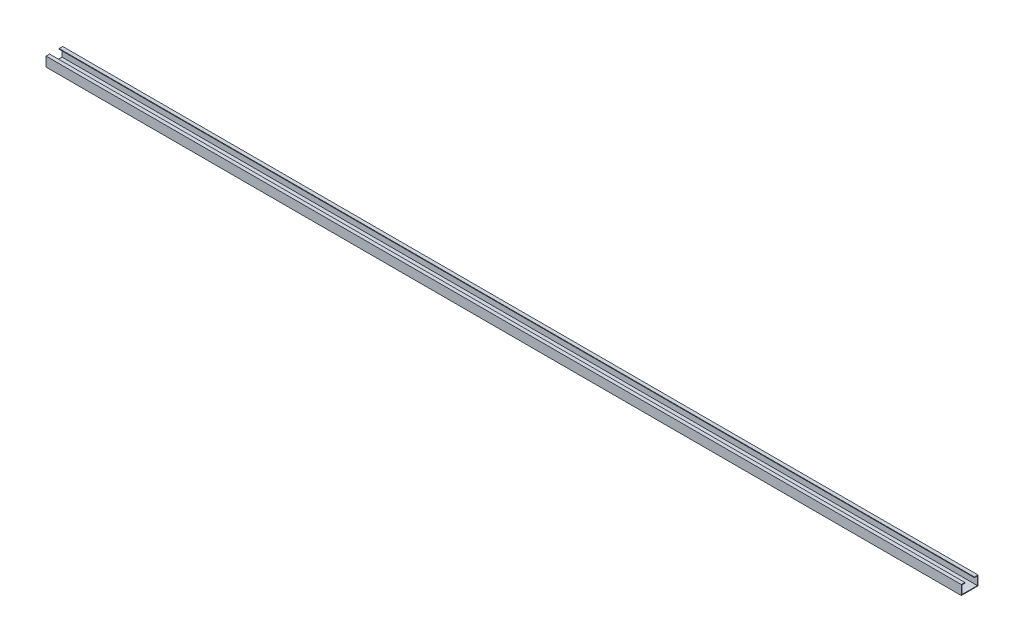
ISO-10303-21;
HEADER;
FILE_DESCRIPTION(('STEP AP214'),'2;1');
FILE_NAME('part.step','',(''),(''),'','','');
FILE_SCHEMA(('AUTOMOTIVE_DESIGN { 1 0 10303 214 1 1 1 1 }'));
ENDSEC;
DATA;
#1=APPLICATION_CONTEXT('core data for automotive mechanical design processes');
#2=APPLICATION_PROTOCOL_DEFINITION('international standard','automotive_design',2000,#1);
#3=PRODUCT_CONTEXT('',#1,'mechanical');
#4=PRODUCT('Part','Part','',(#3));
#5=PRODUCT_RELATED_PRODUCT_CATEGORY('part','',(#4));
#6=PRODUCT_DEFINITION_FORMATION('','',#4);
#7=PRODUCT_DEFINITION_CONTEXT('part definition',#1,'design');
#8=PRODUCT_DEFINITION('design','',#6,#7);
#9=PRODUCT_DEFINITION_SHAPE('','',#8);
#10=(LENGTH_UNIT() NAMED_UNIT(*) SI_UNIT(.MILLI.,.METRE.));
#11=(NAMED_UNIT(*) PLANE_ANGLE_UNIT() SI_UNIT($,.RADIAN.));
#12=(NAMED_UNIT(*) SI_UNIT($,.STERADIAN.) SOLID_ANGLE_UNIT());
#13=UNCERTAINTY_MEASURE_WITH_UNIT(LENGTH_MEASURE(1.E-05),#10,'distance_accuracy_value','');
#14=(GEOMETRIC_REPRESENTATION_CONTEXT(3) GLOBAL_UNCERTAINTY_ASSIGNED_CONTEXT((#13)) GLOBAL_UNIT_ASSIGNED_CONTEXT((#10,
#11,#12)) REPRESENTATION_CONTEXT('',''));
#15=CARTESIAN_POINT('',(0.,0.,0.));
#16=DIRECTION('',(0.,0.,1.));
#17=DIRECTION('',(1.,0.,0.));
#18=AXIS2_PLACEMENT_3D('',#15,#16,#17);
#19=CARTESIAN_POINT('',(2438.4,23.7998,22.225));
#20=DIRECTION('',(0.,1.,0.));
#21=DIRECTION('',(0.,0.,1.));
#22=AXIS2_PLACEMENT_3D('',#19,#20,#21);
#23=PLANE('',#22);
#24=DIRECTION('',(0.,0.,-1.));
#25=VECTOR('',#24,1.);
#26=CARTESIAN_POINT('',(0.,23.7998,22.225));
#27=LINE('',#26,#25);
#28=CARTESIAN_POINT('',(0.,23.7998,20.6248));
#29=VERTEX_POINT('',#28);
#30=CARTESIAN_POINT('',(0.,23.7998,12.7));
#31=VERTEX_POINT('',#30);
#32=EDGE_CURVE('E151',#29,#31,#27,.T.);
#33=ORIENTED_EDGE('',*,*,#32,.T.);
#34=DIRECTION('',(-1.,0.,0.));
#35=VECTOR('',#34,1.);
#36=CARTESIAN_POINT('',(2438.4,23.7998,12.7));
#37=LINE('',#36,#35);
#38=CARTESIAN_POINT('',(2438.4,23.7998,12.7));
#39=VERTEX_POINT('',#38);
#40=EDGE_CURVE('E11',#39,#31,#37,.T.);
#41=ORIENTED_EDGE('',*,*,#40,.F.);
#42=DIRECTION('',(0.,0.,-1.));
#43=VECTOR('',#42,1.);
#44=CARTESIAN_POINT('',(2438.4,23.7998,22.225));
#45=LINE('',#44,#43);
#46=CARTESIAN_POINT('',(2438.4,23.7998,20.6248));
#47=VERTEX_POINT('',#46);
#48=EDGE_CURVE('E99',#47,#39,#45,.T.);
#49=ORIENTED_EDGE('',*,*,#48,.F.);
#50=DIRECTION('',(-1.,0.,0.));
#51=VECTOR('',#50,1.);
#52=CARTESIAN_POINT('',(2438.4,23.7998,20.6248));
#53=LINE('',#52,#51);
#54=EDGE_CURVE('E147',#47,#29,#53,.T.);
#55=ORIENTED_EDGE('',*,*,#54,.T.);
#56=EDGE_LOOP('',(#33,#41,#49,#55));
#57=FACE_BOUND('',#56,.T.);
#58=ADVANCED_FACE('F31',(#57),#23,.F.);
#59=CARTESIAN_POINT('',(2438.4,25.4,12.7));
#60=DIRECTION('',(0.,0.,-1.));
#61=DIRECTION('',(-1.,0.,0.));
#62=AXIS2_PLACEMENT_3D('',#59,#60,#61);
#63=PLANE('',#62);
#64=DIRECTION('',(0.,-1.,0.));
#65=VECTOR('',#64,1.);
#66=CARTESIAN_POINT('',(0.,25.4,12.7));
#67=LINE('',#66,#65);
#68=CARTESIAN_POINT('',(0.,25.4,12.7));
#69=VERTEX_POINT('',#68);
#70=EDGE_CURVE('E154',#69,#31,#67,.T.);
#71=ORIENTED_EDGE('',*,*,#70,.F.);
#72=DIRECTION('',(-1.,0.,0.));
#73=VECTOR('',#72,1.);
#74=CARTESIAN_POINT('',(2438.4,25.4,12.7));
#75=LINE('',#74,#73);
#76=CARTESIAN_POINT('',(2438.4,25.4,12.7));
#77=VERTEX_POINT('',#76);
#78=EDGE_CURVE('E39',#77,#69,#75,.T.);
#79=ORIENTED_EDGE('',*,*,#78,.F.);
#80=DIRECTION('',(0.,-1.,0.));
#81=VECTOR('',#80,1.);
#82=CARTESIAN_POINT('',(2438.4,25.4,12.7));
#83=LINE('',#82,#81);
#84=EDGE_CURVE('E216',#77,#39,#83,.T.);
#85=ORIENTED_EDGE('',*,*,#84,.T.);
#86=ORIENTED_EDGE('',*,*,#40,.T.);
#87=EDGE_LOOP('',(#71,#79,#85,#86));
#88=FACE_BOUND('',#87,.T.);
#89=ADVANCED_FACE('F203',(#88),#63,.T.);
#90=CARTESIAN_POINT('',(2438.4,25.4,22.225));
#91=DIRECTION('',(0.,1.,0.));
#92=DIRECTION('',(0.,0.,1.));
#93=AXIS2_PLACEMENT_3D('',#90,#91,#92);
#94=PLANE('',#93);
#95=DIRECTION('',(0.,0.,-1.));
#96=VECTOR('',#95,1.);
#97=CARTESIAN_POINT('',(0.,25.4,22.225));
#98=LINE('',#97,#96);
#99=CARTESIAN_POINT('',(0.,25.4,22.225));
#100=VERTEX_POINT('',#99);
#101=EDGE_CURVE('E157',#100,#69,#98,.T.);
#102=ORIENTED_EDGE('',*,*,#101,.F.);
#103=DIRECTION('',(-1.,0.,0.));
#104=VECTOR('',#103,1.);
#105=CARTESIAN_POINT('',(2438.4,25.4,22.225));
#106=LINE('',#105,#104);
#107=CARTESIAN_POINT('',(2438.4,25.4,22.225));
#108=VERTEX_POINT('',#107);
#109=EDGE_CURVE('E193',#108,#100,#106,.T.);
#110=ORIENTED_EDGE('',*,*,#109,.F.);
#111=DIRECTION('',(0.,0.,-1.));
#112=VECTOR('',#111,1.);
#113=CARTESIAN_POINT('',(2438.4,25.4,22.225));
#114=LINE('',#113,#112);
#115=EDGE_CURVE('E200',#108,#77,#114,.T.);
#116=ORIENTED_EDGE('',*,*,#115,.T.);
#117=ORIENTED_EDGE('',*,*,#78,.T.);
#118=EDGE_LOOP('',(#102,#110,#116,#117));
#119=FACE_BOUND('',#118,.T.);
#120=ADVANCED_FACE('F198',(#119),#94,.T.);
#121=CARTESIAN_POINT('',(2438.4,0.,22.225));
#122=DIRECTION('',(0.,0.,1.));
#123=DIRECTION('',(1.,0.,0.));
#124=AXIS2_PLACEMENT_3D('',#121,#122,#123);
#125=PLANE('',#124);
#126=DIRECTION('',(0.,1.,0.));
#127=VECTOR('',#126,1.);
#128=CARTESIAN_POINT('',(0.,0.,22.225));
#129=LINE('',#128,#127);
#130=CARTESIAN_POINT('',(0.,0.,22.225));
#131=VERTEX_POINT('',#130);
#132=EDGE_CURVE('E160',#131,#100,#129,.T.);
#133=ORIENTED_EDGE('',*,*,#132,.F.);
#134=DIRECTION('',(-1.,0.,0.));
#135=VECTOR('',#134,1.);
#136=CARTESIAN_POINT('',(2438.4,0.,22.225));
#137=LINE('',#136,#135);
#138=CARTESIAN_POINT('',(2438.4,0.,22.225));
#139=VERTEX_POINT('',#138);
#140=EDGE_CURVE('E191',#139,#131,#137,.T.);
#141=ORIENTED_EDGE('',*,*,#140,.F.);
#142=DIRECTION('',(0.,1.,0.));
#143=VECTOR('',#142,1.);
#144=CARTESIAN_POINT('',(2438.4,0.,22.225));
#145=LINE('',#144,#143);
#146=EDGE_CURVE('E213',#139,#108,#145,.T.);
#147=ORIENTED_EDGE('',*,*,#146,.T.);
#148=ORIENTED_EDGE('',*,*,#109,.T.);
#149=EDGE_LOOP('',(#133,#141,#147,#148));
#150=FACE_BOUND('',#149,.T.);
#151=ADVANCED_FACE('F210',(#150),#125,.T.);
#152=CARTESIAN_POINT('',(2438.4,0.,22.225));
#153=DIRECTION('',(0.,-1.,0.));
#154=DIRECTION('',(0.,0.,-1.));
#155=AXIS2_PLACEMENT_3D('',#152,#153,#154);
#156=PLANE('',#155);
#157=DIRECTION('',(0.,0.,1.));
#158=VECTOR('',#157,1.);
#159=CARTESIAN_POINT('',(0.,0.,22.225));
#160=LINE('',#159,#158);
#161=CARTESIAN_POINT('',(0.,0.,-22.225));
#162=VERTEX_POINT('',#161);
#163=EDGE_CURVE('E163',#162,#131,#160,.T.);
#164=ORIENTED_EDGE('',*,*,#163,.F.);
#165=DIRECTION('',(-1.,0.,0.));
#166=VECTOR('',#165,1.);
#167=CARTESIAN_POINT('',(2438.4,0.,-22.225));
#168=LINE('',#167,#166);
#169=CARTESIAN_POINT('',(2438.4,0.,-22.225));
#170=VERTEX_POINT('',#169);
#171=EDGE_CURVE('E189',#170,#162,#168,.T.);
#172=ORIENTED_EDGE('',*,*,#171,.F.);
#173=DIRECTION('',(0.,0.,1.));
#174=VECTOR('',#173,1.);
#175=CARTESIAN_POINT('',(2438.4,0.,22.225));
#176=LINE('',#175,#174);
#177=EDGE_CURVE('E218',#170,#139,#176,.T.);
#178=ORIENTED_EDGE('',*,*,#177,.T.);
#179=ORIENTED_EDGE('',*,*,#140,.T.);
#180=EDGE_LOOP('',(#164,#172,#178,#179));
#181=FACE_BOUND('',#180,.T.);
#182=ADVANCED_FACE('F318',(#181),#156,.T.);
#183=CARTESIAN_POINT('',(2438.4,0.,-22.225));
#184=DIRECTION('',(0.,0.,-1.));
#185=DIRECTION('',(-1.,0.,0.));
#186=AXIS2_PLACEMENT_3D('',#183,#184,#185);
#187=PLANE('',#186);
#188=DIRECTION('',(0.,-1.,0.));
#189=VECTOR('',#188,1.);
#190=CARTESIAN_POINT('',(0.,0.,-22.225));
#191=LINE('',#190,#189);
#192=CARTESIAN_POINT('',(0.,25.4,-22.225));
#193=VERTEX_POINT('',#192);
#194=EDGE_CURVE('E166',#193,#162,#191,.T.);
#195=ORIENTED_EDGE('',*,*,#194,.F.);
#196=DIRECTION('',(-1.,0.,0.));
#197=VECTOR('',#196,1.);
#198=CARTESIAN_POINT('',(2438.4,25.4,-22.225));
#199=LINE('',#198,#197);
#200=CARTESIAN_POINT('',(2438.4,25.4,-22.225));
#201=VERTEX_POINT('',#200);
#202=EDGE_CURVE('E187',#201,#193,#199,.T.);
#203=ORIENTED_EDGE('',*,*,#202,.F.);
#204=DIRECTION('',(0.,-1.,0.));
#205=VECTOR('',#204,1.);
#206=CARTESIAN_POINT('',(2438.4,0.,-22.225));
#207=LINE('',#206,#205);
#208=EDGE_CURVE('E224',#201,#170,#207,.T.);
#209=ORIENTED_EDGE('',*,*,#208,.T.);
#210=ORIENTED_EDGE('',*,*,#171,.T.);
#211=EDGE_LOOP('',(#195,#203,#209,#210));
#212=FACE_BOUND('',#211,.T.);
#213=ADVANCED_FACE('F309',(#212),#187,.T.);
#214=CARTESIAN_POINT('',(2438.4,25.4,-22.225));
#215=DIRECTION('',(0.,1.,0.));
#216=DIRECTION('',(0.,0.,1.));
#217=AXIS2_PLACEMENT_3D('',#214,#215,#216);
#218=PLANE('',#217);
#219=DIRECTION('',(0.,0.,-1.));
#220=VECTOR('',#219,1.);
#221=CARTESIAN_POINT('',(0.,25.4,-22.225));
#222=LINE('',#221,#220);
#223=CARTESIAN_POINT('',(0.,25.4,-12.7));
#224=VERTEX_POINT('',#223);
#225=EDGE_CURVE('E169',#224,#193,#222,.T.);
#226=ORIENTED_EDGE('',*,*,#225,.F.);
#227=DIRECTION('',(-1.,0.,0.));
#228=VECTOR('',#227,1.);
#229=CARTESIAN_POINT('',(2438.4,25.4,-12.7));
#230=LINE('',#229,#228);
#231=CARTESIAN_POINT('',(2438.4,25.4,-12.7));
#232=VERTEX_POINT('',#231);
#233=EDGE_CURVE('E185',#232,#224,#230,.T.);
#234=ORIENTED_EDGE('',*,*,#233,.F.);
#235=DIRECTION('',(0.,0.,-1.));
#236=VECTOR('',#235,1.);
#237=CARTESIAN_POINT('',(2438.4,25.4,-22.225));
#238=LINE('',#237,#236);
#239=EDGE_CURVE('E227',#232,#201,#238,.T.);
#240=ORIENTED_EDGE('',*,*,#239,.T.);
#241=ORIENTED_EDGE('',*,*,#202,.T.);
#242=EDGE_LOOP('',(#226,#234,#240,#241));
#243=FACE_BOUND('',#242,.T.);
#244=ADVANCED_FACE('F239',(#243),#218,.T.);
#245=CARTESIAN_POINT('',(2438.4,23.7998,-12.7));
#246=DIRECTION('',(0.,0.,1.));
#247=DIRECTION('',(1.,0.,0.));
#248=AXIS2_PLACEMENT_3D('',#245,#246,#247);
#249=PLANE('',#248);
#250=DIRECTION('',(0.,1.,0.));
#251=VECTOR('',#250,1.);
#252=CARTESIAN_POINT('',(0.,23.7998,-12.7));
#253=LINE('',#252,#251);
#254=CARTESIAN_POINT('',(0.,23.7998,-12.7));
#255=VERTEX_POINT('',#254);
#256=EDGE_CURVE('E172',#255,#224,#253,.T.);
#257=ORIENTED_EDGE('',*,*,#256,.F.);
#258=DIRECTION('',(-1.,0.,0.));
#259=VECTOR('',#258,1.);
#260=CARTESIAN_POINT('',(2438.4,23.7998,-12.7));
#261=LINE('',#260,#259);
#262=CARTESIAN_POINT('',(2438.4,23.7998,-12.7));
#263=VERTEX_POINT('',#262);
#264=EDGE_CURVE('E183',#263,#255,#261,.T.);
#265=ORIENTED_EDGE('',*,*,#264,.F.);
#266=DIRECTION('',(0.,1.,0.));
#267=VECTOR('',#266,1.);
#268=CARTESIAN_POINT('',(2438.4,23.7998,-12.7));
#269=LINE('',#268,#267);
#270=EDGE_CURVE('E230',#263,#232,#269,.T.);
#271=ORIENTED_EDGE('',*,*,#270,.T.);
#272=ORIENTED_EDGE('',*,*,#233,.T.);
#273=EDGE_LOOP('',(#257,#265,#271,#272));
#274=FACE_BOUND('',#273,.T.);
#275=ADVANCED_FACE('F234',(#274),#249,.T.);
#276=CARTESIAN_POINT('',(2438.4,23.7998,-22.225));
#277=DIRECTION('',(0.,1.,0.));
#278=DIRECTION('',(0.,0.,1.));
#279=AXIS2_PLACEMENT_3D('',#276,#277,#278);
#280=PLANE('',#279);
#281=DIRECTION('',(0.,0.,-1.));
#282=VECTOR('',#281,1.);
#283=CARTESIAN_POINT('',(0.,23.7998,-22.225));
#284=LINE('',#283,#282);
#285=CARTESIAN_POINT('',(0.,23.7998,-20.6248));
#286=VERTEX_POINT('',#285);
#287=EDGE_CURVE('E175',#255,#286,#284,.T.);
#288=ORIENTED_EDGE('',*,*,#287,.T.);
#289=DIRECTION('',(-1.,0.,0.));
#290=VECTOR('',#289,1.);
#291=CARTESIAN_POINT('',(2438.4,23.7998,-20.6248));
#292=LINE('',#291,#290);
#293=CARTESIAN_POINT('',(2438.4,23.7998,-20.6248));
#294=VERTEX_POINT('',#293);
#295=EDGE_CURVE('E142',#294,#286,#292,.T.);
#296=ORIENTED_EDGE('',*,*,#295,.F.);
#297=DIRECTION('',(0.,0.,-1.));
#298=VECTOR('',#297,1.);
#299=CARTESIAN_POINT('',(2438.4,23.7998,-22.225));
#300=LINE('',#299,#298);
#301=EDGE_CURVE('E133',#263,#294,#300,.T.);
#302=ORIENTED_EDGE('',*,*,#301,.F.);
#303=ORIENTED_EDGE('',*,*,#264,.T.);
#304=EDGE_LOOP('',(#288,#296,#302,#303));
#305=FACE_BOUND('',#304,.T.);
#306=ADVANCED_FACE('F243',(#305),#280,.F.);
#307=CARTESIAN_POINT('',(2438.4,0.,-20.6248));
#308=DIRECTION('',(0.,0.,-1.));
#309=DIRECTION('',(-1.,0.,0.));
#310=AXIS2_PLACEMENT_3D('',#307,#308,#309);
#311=PLANE('',#310);
#312=DIRECTION('',(0.,1.,0.));
#313=VECTOR('',#312,1.);
#314=CARTESIAN_POINT('',(0.,0.,-20.6248));
#315=LINE('',#314,#313);
#316=CARTESIAN_POINT('',(0.,1.6002,-20.6248));
#317=VERTEX_POINT('',#316);
#318=EDGE_CURVE('E141',#286,#317,#315,.F.);
#319=ORIENTED_EDGE('',*,*,#318,.T.);
#320=DIRECTION('',(-1.,0.,0.));
#321=VECTOR('',#320,1.);
#322=CARTESIAN_POINT('',(2438.4,1.6002,-20.6248));
#323=LINE('',#322,#321);
#324=CARTESIAN_POINT('',(2438.4,1.6002,-20.6248));
#325=VERTEX_POINT('',#324);
#326=EDGE_CURVE('E138',#325,#317,#323,.T.);
#327=ORIENTED_EDGE('',*,*,#326,.F.);
#328=DIRECTION('',(0.,1.,0.));
#329=VECTOR('',#328,1.);
#330=CARTESIAN_POINT('',(2438.4,0.,-20.6248));
#331=LINE('',#330,#329);
#332=EDGE_CURVE('E126',#294,#325,#331,.F.);
#333=ORIENTED_EDGE('',*,*,#332,.F.);
#334=ORIENTED_EDGE('',*,*,#295,.T.);
#335=EDGE_LOOP('',(#319,#327,#333,#334));
#336=FACE_BOUND('',#335,.T.);
#337=ADVANCED_FACE('F139',(#336),#311,.F.);
#338=CARTESIAN_POINT('',(2438.4,1.6002,22.225));
#339=DIRECTION('',(0.,-1.,0.));
#340=DIRECTION('',(0.,0.,-1.));
#341=AXIS2_PLACEMENT_3D('',#338,#339,#340);
#342=PLANE('',#341);
#343=DIRECTION('',(0.,0.,-1.));
#344=VECTOR('',#343,1.);
#345=CARTESIAN_POINT('',(0.,1.6002,22.225));
#346=LINE('',#345,#344);
#347=CARTESIAN_POINT('',(0.,1.6002,20.6248));
#348=VERTEX_POINT('',#347);
#349=EDGE_CURVE('E87',#317,#348,#346,.F.);
#350=ORIENTED_EDGE('',*,*,#349,.T.);
#351=DIRECTION('',(-1.,0.,0.));
#352=VECTOR('',#351,1.);
#353=CARTESIAN_POINT('',(2438.4,1.6002,20.6248));
#354=LINE('',#353,#352);
#355=CARTESIAN_POINT('',(2438.4,1.6002,20.6248));
#356=VERTEX_POINT('',#355);
#357=EDGE_CURVE('E143',#356,#348,#354,.T.);
#358=ORIENTED_EDGE('',*,*,#357,.F.);
#359=DIRECTION('',(0.,0.,-1.));
#360=VECTOR('',#359,1.);
#361=CARTESIAN_POINT('',(2438.4,1.6002,22.225));
#362=LINE('',#361,#360);
#363=EDGE_CURVE('E130',#325,#356,#362,.F.);
#364=ORIENTED_EDGE('',*,*,#363,.F.);
#365=ORIENTED_EDGE('',*,*,#326,.T.);
#366=EDGE_LOOP('',(#350,#358,#364,#365));
#367=FACE_BOUND('',#366,.T.);
#368=ADVANCED_FACE('F145',(#367),#342,.F.);
#369=CARTESIAN_POINT('',(2438.4,0.,20.6248));
#370=DIRECTION('',(0.,0.,1.));
#371=DIRECTION('',(1.,0.,0.));
#372=AXIS2_PLACEMENT_3D('',#369,#370,#371);
#373=PLANE('',#372);
#374=DIRECTION('',(0.,1.,0.));
#375=VECTOR('',#374,1.);
#376=CARTESIAN_POINT('',(0.,0.,20.6248));
#377=LINE('',#376,#375);
#378=EDGE_CURVE('E93',#348,#29,#377,.T.);
#379=ORIENTED_EDGE('',*,*,#378,.T.);
#380=ORIENTED_EDGE('',*,*,#54,.F.);
#381=DIRECTION('',(0.,1.,0.));
#382=VECTOR('',#381,1.);
#383=CARTESIAN_POINT('',(2438.4,0.,20.6248));
#384=LINE('',#383,#382);
#385=EDGE_CURVE('E47',#356,#47,#384,.T.);
#386=ORIENTED_EDGE('',*,*,#385,.F.);
#387=ORIENTED_EDGE('',*,*,#357,.T.);
#388=EDGE_LOOP('',(#379,#380,#386,#387));
#389=FACE_BOUND('',#388,.T.);
#390=ADVANCED_FACE('F257',(#389),#373,.F.);
#391=CARTESIAN_POINT('',(2438.4,23.7998,12.7));
#392=DIRECTION('',(-1.,0.,0.));
#393=DIRECTION('',(0.,0.,1.));
#394=AXIS2_PLACEMENT_3D('',#391,#392,#393);
#395=PLANE('',#394);
#396=ORIENTED_EDGE('',*,*,#48,.T.);
#397=ORIENTED_EDGE('',*,*,#84,.F.);
#398=ORIENTED_EDGE('',*,*,#115,.F.);
#399=ORIENTED_EDGE('',*,*,#146,.F.);
#400=ORIENTED_EDGE('',*,*,#177,.F.);
#401=ORIENTED_EDGE('',*,*,#208,.F.);
#402=ORIENTED_EDGE('',*,*,#239,.F.);
#403=ORIENTED_EDGE('',*,*,#270,.F.);
#404=ORIENTED_EDGE('',*,*,#301,.T.);
#405=ORIENTED_EDGE('',*,*,#332,.T.);
#406=ORIENTED_EDGE('',*,*,#363,.T.);
#407=ORIENTED_EDGE('',*,*,#385,.T.);
#408=EDGE_LOOP('',(#396,#397,#398,#399,#400,#401,#402,#403,#404,#405,#406,#407));
#409=FACE_BOUND('',#408,.T.);
#410=ADVANCED_FACE('F128',(#409),#395,.F.);
#411=CARTESIAN_POINT('',(0.,23.7998,12.7));
#412=DIRECTION('',(-1.,0.,0.));
#413=DIRECTION('',(0.,0.,1.));
#414=AXIS2_PLACEMENT_3D('',#411,#412,#413);
#415=PLANE('',#414);
#416=ORIENTED_EDGE('',*,*,#32,.F.);
#417=ORIENTED_EDGE('',*,*,#378,.F.);
#418=ORIENTED_EDGE('',*,*,#349,.F.);
#419=ORIENTED_EDGE('',*,*,#318,.F.);
#420=ORIENTED_EDGE('',*,*,#287,.F.);
#421=ORIENTED_EDGE('',*,*,#256,.T.);
#422=ORIENTED_EDGE('',*,*,#225,.T.);
#423=ORIENTED_EDGE('',*,*,#194,.T.);
#424=ORIENTED_EDGE('',*,*,#163,.T.);
#425=ORIENTED_EDGE('',*,*,#132,.T.);
#426=ORIENTED_EDGE('',*,*,#101,.T.);
#427=ORIENTED_EDGE('',*,*,#70,.T.);
#428=EDGE_LOOP('',(#416,#417,#418,#419,#420,#421,#422,#423,#424,#425,#426,#427));
#429=FACE_BOUND('',#428,.T.);
#430=ADVANCED_FACE('F206',(#429),#415,.T.);
#431=CLOSED_SHELL('',(#58,#89,#120,#151,#182,#213,#244,#275,#306,#337,#368,#390,#410,#430));
#432=MANIFOLD_SOLID_BREP('B2',#431);
#433=ADVANCED_BREP_SHAPE_REPRESENTATION('',(#18,#432),#14);
#434=SHAPE_DEFINITION_REPRESENTATION(#9,#433);
ENDSEC;
END-ISO-10303-21;
